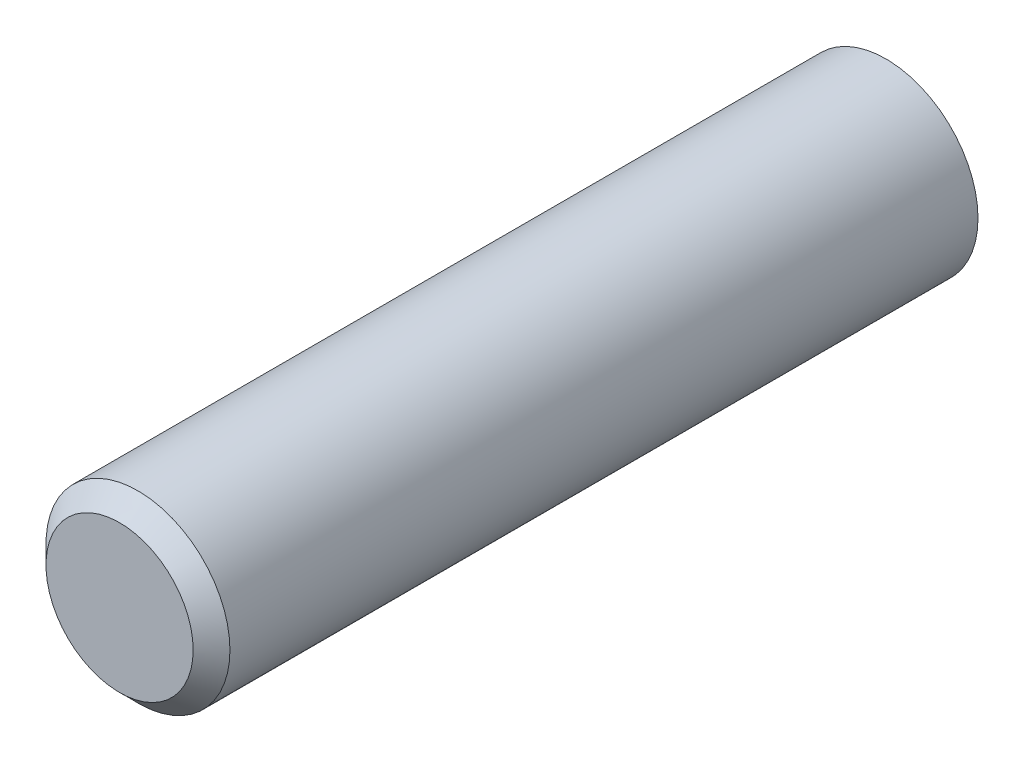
ISO-10303-21;
HEADER;
FILE_DESCRIPTION(('STEP AP214'),'2;1');
FILE_NAME('part.step','',(''),(''),'','','');
FILE_SCHEMA(('AUTOMOTIVE_DESIGN { 1 0 10303 214 1 1 1 1 }'));
ENDSEC;
DATA;
#1=APPLICATION_CONTEXT('core data for automotive mechanical design processes');
#2=APPLICATION_PROTOCOL_DEFINITION('international standard','automotive_design',2000,#1);
#3=PRODUCT_CONTEXT('',#1,'mechanical');
#4=PRODUCT('Part','Part','',(#3));
#5=PRODUCT_RELATED_PRODUCT_CATEGORY('part','',(#4));
#6=PRODUCT_DEFINITION_FORMATION('','',#4);
#7=PRODUCT_DEFINITION_CONTEXT('part definition',#1,'design');
#8=PRODUCT_DEFINITION('design','',#6,#7);
#9=PRODUCT_DEFINITION_SHAPE('','',#8);
#10=(LENGTH_UNIT() NAMED_UNIT(*) SI_UNIT(.MILLI.,.METRE.));
#11=(NAMED_UNIT(*) PLANE_ANGLE_UNIT() SI_UNIT($,.RADIAN.));
#12=(NAMED_UNIT(*) SI_UNIT($,.STERADIAN.) SOLID_ANGLE_UNIT());
#13=UNCERTAINTY_MEASURE_WITH_UNIT(LENGTH_MEASURE(1.E-05),#10,'distance_accuracy_value','');
#14=(GEOMETRIC_REPRESENTATION_CONTEXT(3) GLOBAL_UNCERTAINTY_ASSIGNED_CONTEXT((#13)) GLOBAL_UNIT_ASSIGNED_CONTEXT((#10,
#11,#12)) REPRESENTATION_CONTEXT('',''));
#15=CARTESIAN_POINT('',(0.,0.,0.));
#16=DIRECTION('',(0.,0.,1.));
#17=DIRECTION('',(1.,0.,0.));
#18=AXIS2_PLACEMENT_3D('',#15,#16,#17);
#19=CARTESIAN_POINT('',(0.,0.,25.));
#20=DIRECTION('',(0.,0.,-1.));
#21=DIRECTION('',(-1.,0.,0.));
#22=AXIS2_PLACEMENT_3D('',#19,#20,#21);
#23=CYLINDRICAL_SURFACE('',#22,6.);
#24=CARTESIAN_POINT('',(0.,0.,23.8));
#25=DIRECTION('',(0.,0.,1.));
#26=DIRECTION('',(1.,0.,0.));
#27=AXIS2_PLACEMENT_3D('',#24,#25,#26);
#28=CIRCLE('',#27,6.);
#29=CARTESIAN_POINT('',(6.,0.,23.8));
#30=VERTEX_POINT('',#29);
#31=EDGE_CURVE('E10',#30,#30,#28,.F.);
#32=ORIENTED_EDGE('',*,*,#31,.T.);
#33=EDGE_LOOP('',(#32));
#34=FACE_BOUND('',#33,.T.);
#35=CARTESIAN_POINT('',(0.,0.,-25.));
#36=DIRECTION('',(0.,0.,1.));
#37=DIRECTION('',(1.,0.,0.));
#38=AXIS2_PLACEMENT_3D('',#35,#36,#37);
#39=CIRCLE('',#38,6.);
#40=CARTESIAN_POINT('',(6.,0.,-25.));
#41=VERTEX_POINT('',#40);
#42=EDGE_CURVE('E41',#41,#41,#39,.T.);
#43=ORIENTED_EDGE('',*,*,#42,.T.);
#44=EDGE_LOOP('',(#43));
#45=FACE_BOUND('',#44,.T.);
#46=ADVANCED_FACE('F30',(#34,#45),#23,.T.);
#47=CARTESIAN_POINT('',(0.,0.,25.));
#48=DIRECTION('',(0.,0.,1.));
#49=DIRECTION('',(1.,0.,0.));
#50=AXIS2_PLACEMENT_3D('',#47,#48,#49);
#51=PLANE('',#50);
#52=CARTESIAN_POINT('',(0.,0.,25.));
#53=DIRECTION('',(0.,0.,1.));
#54=DIRECTION('',(1.,0.,0.));
#55=AXIS2_PLACEMENT_3D('',#52,#53,#54);
#56=CIRCLE('',#55,4.80000000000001);
#57=CARTESIAN_POINT('',(4.80000000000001,0.,25.));
#58=VERTEX_POINT('',#57);
#59=EDGE_CURVE('E37',#58,#58,#56,.T.);
#60=ORIENTED_EDGE('',*,*,#59,.T.);
#61=EDGE_LOOP('',(#60));
#62=FACE_BOUND('',#61,.T.);
#63=ADVANCED_FACE('F51',(#62),#51,.T.);
#64=CARTESIAN_POINT('',(0.,0.,-25.));
#65=DIRECTION('',(0.,0.,1.));
#66=DIRECTION('',(1.,0.,0.));
#67=AXIS2_PLACEMENT_3D('',#64,#65,#66);
#68=PLANE('',#67);
#69=ORIENTED_EDGE('',*,*,#42,.F.);
#70=EDGE_LOOP('',(#69));
#71=FACE_BOUND('',#70,.T.);
#72=ADVANCED_FACE('F49',(#71),#68,.F.);
#73=CARTESIAN_POINT('',(0.,0.,25.));
#74=DIRECTION('',(0.,0.,-1.));
#75=DIRECTION('',(-1.,0.,0.));
#76=AXIS2_PLACEMENT_3D('',#73,#74,#75);
#77=CONICAL_SURFACE('',#76,4.80000000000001,0.785398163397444);
#78=ORIENTED_EDGE('',*,*,#31,.F.);
#79=EDGE_LOOP('',(#78));
#80=FACE_BOUND('',#79,.T.);
#81=ORIENTED_EDGE('',*,*,#59,.F.);
#82=EDGE_LOOP('',(#81));
#83=FACE_BOUND('',#82,.T.);
#84=ADVANCED_FACE('F32',(#80,#83),#77,.T.);
#85=CLOSED_SHELL('',(#46,#63,#72,#84));
#86=MANIFOLD_SOLID_BREP('B2',#85);
#87=ADVANCED_BREP_SHAPE_REPRESENTATION('',(#18,#86),#14);
#88=SHAPE_DEFINITION_REPRESENTATION(#9,#87);
ENDSEC;
END-ISO-10303-21;
